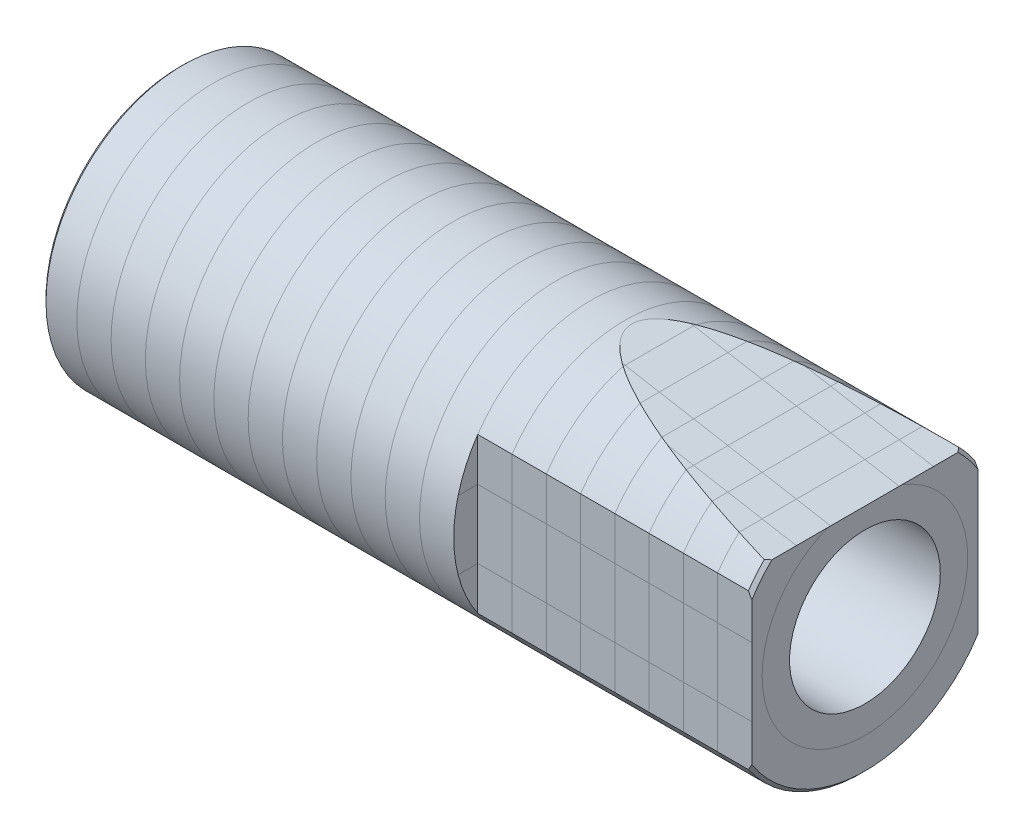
from build123d import *

# Parameters (mm, degrees)
SKETCH_1_W               = 10
SKETCH_1_H               = 2
FILLET_1_R               = 0.1
CHAMFER_2_SIZE           = 0.05
CUT_EXTRUDE_1_DEPTH      = 5.6
CUT_EXTRUDE_2_DEPTH      = 11.392304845
CUT_EXTRUDE_2_DEPTH_BACK = 11.392304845
CUT_EXTRUDE_3_DEPTH      = 11.392304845
CUT_EXTRUDE_3_DEPTH_BACK = 11.392304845
SKETCH_5_W               = 4
SKETCH_5_H               = 0.35


with BuildPart() as part:
    # Sketch 1 → Revolve 1 (revolve)
    with BuildSketch(Plane.XY, mode=Mode.PRIVATE) as revolve_1_sk:
        with Locations((5, 1)):
            Rectangle(SKETCH_1_W, SKETCH_1_H)
    revolve(revolve_1_sk.sketch.rotate(Axis((0, 0, 0), (1, 0, 0)), 90), axis=Axis((0, 0, 0), (1, 0, 0)))

    # Sketch 2 → Cut-Revolve 1 (revolve, cut)
    with BuildSketch(Plane.XY, mode=Mode.PRIVATE) as cut_revolve_1_sk:
        Polygon((0, 0), (0, 1.85), (0.109852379, 1.740147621), (1.114983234, 1.65), (3, 1.65), (3.216506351, 1.275), (6.7, 1.275), (7.003108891, 0.75), (7.5, 0.75), (7.5, 1.1), (10, 1.1), (10, 0), align=None)
    revolve(cut_revolve_1_sk.sketch.rotate(Axis((0, 0, 0), (-1, 0, 0)), 90), axis=Axis((0, 0, 0), (-1, 0, 0)), mode=Mode.SUBTRACT)

    # Fillet 1
    fillet_1_edges = [part.edges().sort_by_distance(p)[0] for p in [
        (7.5, 0, 1.1),
    ]]
    fillet(fillet_1_edges, radius=FILLET_1_R)

    # Chamfer 2
    chamfer_2_edges = [part.edges().sort_by_distance(p)[0] for p in [
        (10, 0, -2),
        (0, 0, -2),
    ]]
    chamfer(chamfer_2_edges, length=CHAMFER_2_SIZE)

    # Sketch 3 → Cut-Extrude 1 (cut)
    with BuildSketch(Plane.ZY):
        Polygon((-1.454922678, 0), (-0.727461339, -1.26), (0.727461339, -1.26), (1.454922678, 0), (0.727461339, 1.26), (-0.727461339, 1.26), align=None)
    extrude(amount=-CUT_EXTRUDE_1_DEPTH, mode=Mode.SUBTRACT)

    # Sketch 4 → Cut-Extrude 2 (cut, two sides: drawn at the far end of the back side and taken through both)
    with BuildSketch(Plane.XY.offset(-CUT_EXTRUDE_2_DEPTH_BACK)):
        Polygon((10, 1.4), (6.597230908, 2), (10, 2), align=None)
    extrude(amount=CUT_EXTRUDE_2_DEPTH + CUT_EXTRUDE_2_DEPTH_BACK, mode=Mode.SUBTRACT)

    # Sketch 5 → Cut-Extrude 3 (cut, two sides: drawn at the far end of the back side and taken through both)
    with BuildSketch(Plane(origin=(0, 0, 0), x_dir=(1, 0, 0), z_dir=(0, 1, 0)).offset(-CUT_EXTRUDE_3_DEPTH_BACK)):
        with Locations((8, -1.825)):
            Rectangle(SKETCH_5_W, SKETCH_5_H)
        with Locations((8, 1.825)):
            Rectangle(SKETCH_5_W, SKETCH_5_H)
    extrude(amount=CUT_EXTRUDE_3_DEPTH + CUT_EXTRUDE_3_DEPTH_BACK, mode=Mode.SUBTRACT)


solid = part.part
